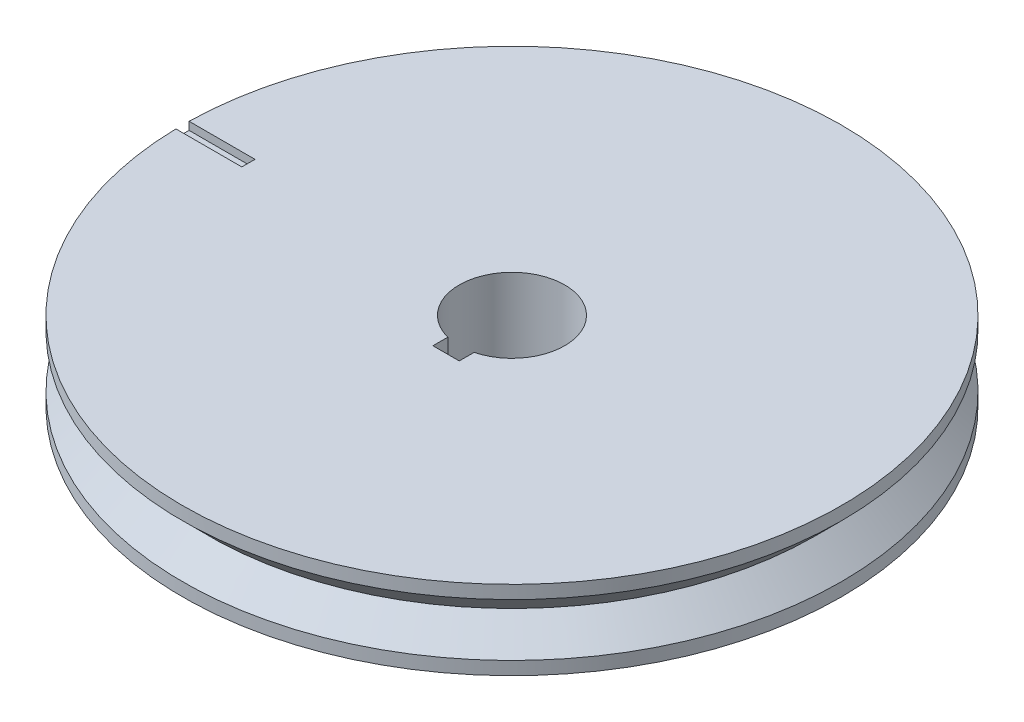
ISO-10303-21;
HEADER;
FILE_DESCRIPTION(('STEP AP214'),'2;1');
FILE_NAME('part.step','',(''),(''),'','','');
FILE_SCHEMA(('AUTOMOTIVE_DESIGN { 1 0 10303 214 1 1 1 1 }'));
ENDSEC;
DATA;
#1=APPLICATION_CONTEXT('core data for automotive mechanical design processes');
#2=APPLICATION_PROTOCOL_DEFINITION('international standard','automotive_design',2000,#1);
#3=PRODUCT_CONTEXT('',#1,'mechanical');
#4=PRODUCT('Part','Part','',(#3));
#5=PRODUCT_RELATED_PRODUCT_CATEGORY('part','',(#4));
#6=PRODUCT_DEFINITION_FORMATION('','',#4);
#7=PRODUCT_DEFINITION_CONTEXT('part definition',#1,'design');
#8=PRODUCT_DEFINITION('design','',#6,#7);
#9=PRODUCT_DEFINITION_SHAPE('','',#8);
#10=(LENGTH_UNIT() NAMED_UNIT(*) SI_UNIT(.MILLI.,.METRE.));
#11=(NAMED_UNIT(*) PLANE_ANGLE_UNIT() SI_UNIT($,.RADIAN.));
#12=(NAMED_UNIT(*) SI_UNIT($,.STERADIAN.) SOLID_ANGLE_UNIT());
#13=UNCERTAINTY_MEASURE_WITH_UNIT(LENGTH_MEASURE(1.E-05),#10,'distance_accuracy_value','');
#14=(GEOMETRIC_REPRESENTATION_CONTEXT(3) GLOBAL_UNCERTAINTY_ASSIGNED_CONTEXT((#13)) GLOBAL_UNIT_ASSIGNED_CONTEXT((#10,
#11,#12)) REPRESENTATION_CONTEXT('',''));
#15=CARTESIAN_POINT('',(0.,0.,0.));
#16=DIRECTION('',(0.,0.,1.));
#17=DIRECTION('',(1.,0.,0.));
#18=AXIS2_PLACEMENT_3D('',#15,#16,#17);
#19=CARTESIAN_POINT('',(0.,-15.,0.));
#20=DIRECTION('',(0.,1.,0.));
#21=DIRECTION('',(-1.,0.,0.));
#22=AXIS2_PLACEMENT_3D('',#19,#20,#21);
#23=PLANE('',#22);
#24=CARTESIAN_POINT('',(0.,-15.,0.));
#25=DIRECTION('',(0.,1.,0.));
#26=DIRECTION('',(-1.,0.,0.));
#27=AXIS2_PLACEMENT_3D('',#24,#25,#26);
#28=CIRCLE('',#27,20.);
#29=CARTESIAN_POINT('',(5.,-15.,19.3649167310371));
#30=VERTEX_POINT('',#29);
#31=CARTESIAN_POINT('',(-5.,-15.,19.3649167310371));
#32=VERTEX_POINT('',#31);
#33=EDGE_CURVE('E150',#30,#32,#28,.T.);
#34=ORIENTED_EDGE('',*,*,#33,.T.);
#35=DIRECTION('',(0.,0.,1.));
#36=VECTOR('',#35,1.);
#37=CARTESIAN_POINT('',(-5.,-15.,19.3649167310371));
#38=LINE('',#37,#36);
#39=CARTESIAN_POINT('',(-5.,-15.,25.));
#40=VERTEX_POINT('',#39);
#41=EDGE_CURVE('E153',#32,#40,#38,.T.);
#42=ORIENTED_EDGE('',*,*,#41,.T.);
#43=DIRECTION('',(1.,0.,0.));
#44=VECTOR('',#43,1.);
#45=CARTESIAN_POINT('',(5.,-15.,25.));
#46=LINE('',#45,#44);
#47=CARTESIAN_POINT('',(5.,-15.,25.));
#48=VERTEX_POINT('',#47);
#49=EDGE_CURVE('E158',#40,#48,#46,.T.);
#50=ORIENTED_EDGE('',*,*,#49,.T.);
#51=DIRECTION('',(0.,0.,-1.));
#52=VECTOR('',#51,1.);
#53=CARTESIAN_POINT('',(5.,-15.,19.3649167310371));
#54=LINE('',#53,#52);
#55=EDGE_CURVE('E53',#48,#30,#54,.T.);
#56=ORIENTED_EDGE('',*,*,#55,.T.);
#57=EDGE_LOOP('',(#34,#42,#50,#56));
#58=FACE_BOUND('',#57,.T.);
#59=CARTESIAN_POINT('',(0.,-15.,0.));
#60=DIRECTION('',(0.,1.,0.));
#61=DIRECTION('',(-1.,0.,0.));
#62=AXIS2_PLACEMENT_3D('',#59,#60,#61);
#63=CIRCLE('',#62,125.);
#64=CARTESIAN_POINT('',(-125.,-15.,0.));
#65=VERTEX_POINT('',#64);
#66=EDGE_CURVE('E11',#65,#65,#63,.T.);
#67=ORIENTED_EDGE('',*,*,#66,.F.);
#68=EDGE_LOOP('',(#67));
#69=FACE_BOUND('',#68,.T.);
#70=ADVANCED_FACE('F31',(#58,#69),#23,.F.);
#71=CARTESIAN_POINT('',(0.,-15.,0.));
#72=DIRECTION('',(0.,1.,0.));
#73=DIRECTION('',(-1.,0.,0.));
#74=AXIS2_PLACEMENT_3D('',#71,#72,#73);
#75=CYLINDRICAL_SURFACE('',#74,125.);
#76=CARTESIAN_POINT('',(0.,-10.,0.));
#77=DIRECTION('',(0.,1.,0.));
#78=DIRECTION('',(-1.,0.,0.));
#79=AXIS2_PLACEMENT_3D('',#76,#77,#78);
#80=CIRCLE('',#79,125.);
#81=CARTESIAN_POINT('',(-125.,-10.,0.));
#82=VERTEX_POINT('',#81);
#83=EDGE_CURVE('E38',#82,#82,#80,.T.);
#84=ORIENTED_EDGE('',*,*,#83,.F.);
#85=EDGE_LOOP('',(#84));
#86=FACE_BOUND('',#85,.T.);
#87=ORIENTED_EDGE('',*,*,#66,.T.);
#88=EDGE_LOOP('',(#87));
#89=FACE_BOUND('',#88,.T.);
#90=ADVANCED_FACE('F136',(#86,#89),#75,.T.);
#91=CARTESIAN_POINT('',(0.,-10.,0.));
#92=DIRECTION('',(0.,-1.,0.));
#93=DIRECTION('',(1.,0.,0.));
#94=AXIS2_PLACEMENT_3D('',#91,#92,#93);
#95=CONICAL_SURFACE('',#94,125.,0.785398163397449);
#96=CARTESIAN_POINT('',(0.,0.,0.));
#97=DIRECTION('',(0.,1.,0.));
#98=DIRECTION('',(-1.,0.,0.));
#99=AXIS2_PLACEMENT_3D('',#96,#97,#98);
#100=CIRCLE('',#99,115.);
#101=CARTESIAN_POINT('',(-115.,0.,0.));
#102=VERTEX_POINT('',#101);
#103=EDGE_CURVE('E122',#102,#102,#100,.T.);
#104=ORIENTED_EDGE('',*,*,#103,.F.);
#105=EDGE_LOOP('',(#104));
#106=FACE_BOUND('',#105,.T.);
#107=ORIENTED_EDGE('',*,*,#83,.T.);
#108=EDGE_LOOP('',(#107));
#109=FACE_BOUND('',#108,.T.);
#110=ADVANCED_FACE('F134',(#106,#109),#95,.T.);
#111=CARTESIAN_POINT('',(0.,0.,0.));
#112=DIRECTION('',(0.,1.,0.));
#113=DIRECTION('',(-1.,0.,0.));
#114=AXIS2_PLACEMENT_3D('',#111,#112,#113);
#115=CONICAL_SURFACE('',#114,115.,0.785398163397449);
#116=CARTESIAN_POINT('',(0.,10.,0.));
#117=DIRECTION('',(0.,1.,0.));
#118=DIRECTION('',(-1.,0.,0.));
#119=AXIS2_PLACEMENT_3D('',#116,#117,#118);
#120=CIRCLE('',#119,125.);
#121=CARTESIAN_POINT('',(-125.,10.,0.));
#122=VERTEX_POINT('',#121);
#123=EDGE_CURVE('E118',#122,#122,#120,.T.);
#124=ORIENTED_EDGE('',*,*,#123,.F.);
#125=EDGE_LOOP('',(#124));
#126=FACE_BOUND('',#125,.T.);
#127=ORIENTED_EDGE('',*,*,#103,.T.);
#128=EDGE_LOOP('',(#127));
#129=FACE_BOUND('',#128,.T.);
#130=ADVANCED_FACE('F227',(#126,#129),#115,.T.);
#131=CARTESIAN_POINT('',(0.,-15.,0.));
#132=DIRECTION('',(0.,1.,0.));
#133=DIRECTION('',(-1.,0.,0.));
#134=AXIS2_PLACEMENT_3D('',#131,#132,#133);
#135=CYLINDRICAL_SURFACE('',#134,125.);
#136=CARTESIAN_POINT('',(0.,15.,0.));
#137=DIRECTION('',(0.,1.,0.));
#138=DIRECTION('',(-1.,0.,0.));
#139=AXIS2_PLACEMENT_3D('',#136,#137,#138);
#140=CIRCLE('',#139,125.);
#141=CARTESIAN_POINT('',(-124.9749974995,15.,2.50000000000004));
#142=VERTEX_POINT('',#141);
#143=CARTESIAN_POINT('',(-124.9749974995,15.,-2.5));
#144=VERTEX_POINT('',#143);
#145=EDGE_CURVE('E111',#142,#144,#140,.T.);
#146=ORIENTED_EDGE('',*,*,#145,.F.);
#147=DIRECTION('',(0.,1.,0.));
#148=VECTOR('',#147,1.);
#149=CARTESIAN_POINT('',(-124.9749974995,12.,2.50000000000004));
#150=LINE('',#149,#148);
#151=CARTESIAN_POINT('',(-124.9749974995,12.,2.50000000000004));
#152=VERTEX_POINT('',#151);
#153=EDGE_CURVE('E113',#152,#142,#150,.T.);
#154=ORIENTED_EDGE('',*,*,#153,.F.);
#155=CARTESIAN_POINT('',(0.,12.,0.));
#156=DIRECTION('',(0.,1.,0.));
#157=DIRECTION('',(-1.,0.,0.));
#158=AXIS2_PLACEMENT_3D('',#155,#156,#157);
#159=CIRCLE('',#158,125.);
#160=CARTESIAN_POINT('',(-124.9749974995,12.,-2.5));
#161=VERTEX_POINT('',#160);
#162=EDGE_CURVE('E112',#161,#152,#159,.T.);
#163=ORIENTED_EDGE('',*,*,#162,.F.);
#164=DIRECTION('',(0.,1.,0.));
#165=VECTOR('',#164,1.);
#166=CARTESIAN_POINT('',(-124.9749974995,12.,-2.5));
#167=LINE('',#166,#165);
#168=EDGE_CURVE('E98',#161,#144,#167,.T.);
#169=ORIENTED_EDGE('',*,*,#168,.T.);
#170=EDGE_LOOP('',(#146,#154,#163,#169));
#171=FACE_BOUND('',#170,.T.);
#172=ORIENTED_EDGE('',*,*,#123,.T.);
#173=EDGE_LOOP('',(#172));
#174=FACE_BOUND('',#173,.T.);
#175=ADVANCED_FACE('F108',(#171,#174),#135,.T.);
#176=CARTESIAN_POINT('',(0.,15.,0.));
#177=DIRECTION('',(0.,-1.,0.));
#178=DIRECTION('',(1.,0.,0.));
#179=AXIS2_PLACEMENT_3D('',#176,#177,#178);
#180=PLANE('',#179);
#181=DIRECTION('',(1.,0.,0.));
#182=VECTOR('',#181,1.);
#183=CARTESIAN_POINT('',(5.,15.,25.));
#184=LINE('',#183,#182);
#185=CARTESIAN_POINT('',(-5.,15.,25.));
#186=VERTEX_POINT('',#185);
#187=CARTESIAN_POINT('',(5.,15.,25.));
#188=VERTEX_POINT('',#187);
#189=EDGE_CURVE('E171',#186,#188,#184,.T.);
#190=ORIENTED_EDGE('',*,*,#189,.F.);
#191=DIRECTION('',(0.,0.,1.));
#192=VECTOR('',#191,1.);
#193=CARTESIAN_POINT('',(-5.,15.,19.3649167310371));
#194=LINE('',#193,#192);
#195=CARTESIAN_POINT('',(-5.,15.,19.3649167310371));
#196=VERTEX_POINT('',#195);
#197=EDGE_CURVE('E175',#196,#186,#194,.T.);
#198=ORIENTED_EDGE('',*,*,#197,.F.);
#199=CARTESIAN_POINT('',(0.,15.,0.));
#200=DIRECTION('',(0.,1.,0.));
#201=DIRECTION('',(-1.,0.,0.));
#202=AXIS2_PLACEMENT_3D('',#199,#200,#201);
#203=CIRCLE('',#202,20.);
#204=CARTESIAN_POINT('',(5.,15.,19.3649167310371));
#205=VERTEX_POINT('',#204);
#206=EDGE_CURVE('E178',#205,#196,#203,.T.);
#207=ORIENTED_EDGE('',*,*,#206,.F.);
#208=DIRECTION('',(0.,0.,-1.));
#209=VECTOR('',#208,1.);
#210=CARTESIAN_POINT('',(5.,15.,19.3649167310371));
#211=LINE('',#210,#209);
#212=EDGE_CURVE('E166',#188,#205,#211,.T.);
#213=ORIENTED_EDGE('',*,*,#212,.F.);
#214=EDGE_LOOP('',(#190,#198,#207,#213));
#215=FACE_BOUND('',#214,.T.);
#216=DIRECTION('',(0.,0.,-1.));
#217=VECTOR('',#216,1.);
#218=CARTESIAN_POINT('',(-99.9749974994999,15.,-2.5));
#219=LINE('',#218,#217);
#220=CARTESIAN_POINT('',(-99.9749974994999,15.,2.5));
#221=VERTEX_POINT('',#220);
#222=CARTESIAN_POINT('',(-99.9749974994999,15.,-2.5));
#223=VERTEX_POINT('',#222);
#224=EDGE_CURVE('E45',#221,#223,#219,.T.);
#225=ORIENTED_EDGE('',*,*,#224,.F.);
#226=DIRECTION('',(1.,0.,0.));
#227=VECTOR('',#226,1.);
#228=CARTESIAN_POINT('',(-99.9749974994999,15.,2.5));
#229=LINE('',#228,#227);
#230=EDGE_CURVE('E103',#142,#221,#229,.T.);
#231=ORIENTED_EDGE('',*,*,#230,.F.);
#232=ORIENTED_EDGE('',*,*,#145,.T.);
#233=DIRECTION('',(-1.,0.,0.));
#234=VECTOR('',#233,1.);
#235=CARTESIAN_POINT('',(-99.9749974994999,15.,-2.5));
#236=LINE('',#235,#234);
#237=EDGE_CURVE('E94',#223,#144,#236,.T.);
#238=ORIENTED_EDGE('',*,*,#237,.F.);
#239=EDGE_LOOP('',(#225,#231,#232,#238));
#240=FACE_BOUND('',#239,.T.);
#241=ADVANCED_FACE('F116',(#215,#240),#180,.F.);
#242=CARTESIAN_POINT('',(-5.,-15.,19.3649167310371));
#243=DIRECTION('',(-1.,0.,0.));
#244=DIRECTION('',(0.,0.,1.));
#245=AXIS2_PLACEMENT_3D('',#242,#243,#244);
#246=PLANE('',#245);
#247=ORIENTED_EDGE('',*,*,#197,.T.);
#248=DIRECTION('',(0.,1.,0.));
#249=VECTOR('',#248,1.);
#250=CARTESIAN_POINT('',(-5.,-15.,25.));
#251=LINE('',#250,#249);
#252=EDGE_CURVE('E127',#40,#186,#251,.T.);
#253=ORIENTED_EDGE('',*,*,#252,.F.);
#254=ORIENTED_EDGE('',*,*,#41,.F.);
#255=DIRECTION('',(0.,1.,0.));
#256=VECTOR('',#255,1.);
#257=CARTESIAN_POINT('',(-5.,-15.,19.3649167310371));
#258=LINE('',#257,#256);
#259=EDGE_CURVE('E119',#32,#196,#258,.T.);
#260=ORIENTED_EDGE('',*,*,#259,.T.);
#261=EDGE_LOOP('',(#247,#253,#254,#260));
#262=FACE_BOUND('',#261,.T.);
#263=ADVANCED_FACE('F219',(#262),#246,.F.);
#264=CARTESIAN_POINT('',(0.,-15.,0.));
#265=DIRECTION('',(0.,1.,0.));
#266=DIRECTION('',(-1.,0.,0.));
#267=AXIS2_PLACEMENT_3D('',#264,#265,#266);
#268=CYLINDRICAL_SURFACE('',#267,20.);
#269=ORIENTED_EDGE('',*,*,#206,.T.);
#270=ORIENTED_EDGE('',*,*,#259,.F.);
#271=ORIENTED_EDGE('',*,*,#33,.F.);
#272=DIRECTION('',(0.,1.,0.));
#273=VECTOR('',#272,1.);
#274=CARTESIAN_POINT('',(5.,-15.,19.3649167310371));
#275=LINE('',#274,#273);
#276=EDGE_CURVE('E124',#30,#205,#275,.T.);
#277=ORIENTED_EDGE('',*,*,#276,.T.);
#278=EDGE_LOOP('',(#269,#270,#271,#277));
#279=FACE_BOUND('',#278,.T.);
#280=ADVANCED_FACE('F216',(#279),#268,.F.);
#281=CARTESIAN_POINT('',(5.,-15.,19.3649167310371));
#282=DIRECTION('',(1.,0.,0.));
#283=DIRECTION('',(0.,0.,-1.));
#284=AXIS2_PLACEMENT_3D('',#281,#282,#283);
#285=PLANE('',#284);
#286=ORIENTED_EDGE('',*,*,#212,.T.);
#287=ORIENTED_EDGE('',*,*,#276,.F.);
#288=ORIENTED_EDGE('',*,*,#55,.F.);
#289=DIRECTION('',(0.,1.,0.));
#290=VECTOR('',#289,1.);
#291=CARTESIAN_POINT('',(5.,-15.,25.));
#292=LINE('',#291,#290);
#293=EDGE_CURVE('E157',#48,#188,#292,.T.);
#294=ORIENTED_EDGE('',*,*,#293,.T.);
#295=EDGE_LOOP('',(#286,#287,#288,#294));
#296=FACE_BOUND('',#295,.T.);
#297=ADVANCED_FACE('F164',(#296),#285,.F.);
#298=CARTESIAN_POINT('',(5.,-15.,25.));
#299=DIRECTION('',(0.,0.,1.));
#300=DIRECTION('',(1.,0.,0.));
#301=AXIS2_PLACEMENT_3D('',#298,#299,#300);
#302=PLANE('',#301);
#303=ORIENTED_EDGE('',*,*,#189,.T.);
#304=ORIENTED_EDGE('',*,*,#293,.F.);
#305=ORIENTED_EDGE('',*,*,#49,.F.);
#306=ORIENTED_EDGE('',*,*,#252,.T.);
#307=EDGE_LOOP('',(#303,#304,#305,#306));
#308=FACE_BOUND('',#307,.T.);
#309=ADVANCED_FACE('F172',(#308),#302,.F.);
#310=CARTESIAN_POINT('',(-99.9749974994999,12.,-2.5));
#311=DIRECTION('',(1.,0.,0.));
#312=DIRECTION('',(0.,1.,0.));
#313=AXIS2_PLACEMENT_3D('',#310,#311,#312);
#314=PLANE('',#313);
#315=ORIENTED_EDGE('',*,*,#224,.T.);
#316=DIRECTION('',(0.,1.,0.));
#317=VECTOR('',#316,1.);
#318=CARTESIAN_POINT('',(-99.9749974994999,12.,-2.5));
#319=LINE('',#318,#317);
#320=CARTESIAN_POINT('',(-99.9749974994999,12.,-2.5));
#321=VERTEX_POINT('',#320);
#322=EDGE_CURVE('E100',#321,#223,#319,.T.);
#323=ORIENTED_EDGE('',*,*,#322,.F.);
#324=DIRECTION('',(0.,0.,-1.));
#325=VECTOR('',#324,1.);
#326=CARTESIAN_POINT('',(-99.9749974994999,12.,-2.5));
#327=LINE('',#326,#325);
#328=CARTESIAN_POINT('',(-99.9749974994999,12.,2.5));
#329=VERTEX_POINT('',#328);
#330=EDGE_CURVE('E194',#329,#321,#327,.T.);
#331=ORIENTED_EDGE('',*,*,#330,.F.);
#332=DIRECTION('',(0.,1.,0.));
#333=VECTOR('',#332,1.);
#334=CARTESIAN_POINT('',(-99.9749974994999,12.,2.5));
#335=LINE('',#334,#333);
#336=EDGE_CURVE('E184',#329,#221,#335,.T.);
#337=ORIENTED_EDGE('',*,*,#336,.T.);
#338=EDGE_LOOP('',(#315,#323,#331,#337));
#339=FACE_BOUND('',#338,.T.);
#340=ADVANCED_FACE('F204',(#339),#314,.F.);
#341=CARTESIAN_POINT('',(-99.9749974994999,12.,2.5));
#342=DIRECTION('',(0.,0.,1.));
#343=DIRECTION('',(1.,0.,0.));
#344=AXIS2_PLACEMENT_3D('',#341,#342,#343);
#345=PLANE('',#344);
#346=ORIENTED_EDGE('',*,*,#230,.T.);
#347=ORIENTED_EDGE('',*,*,#336,.F.);
#348=DIRECTION('',(1.,0.,0.));
#349=VECTOR('',#348,1.);
#350=CARTESIAN_POINT('',(-99.9749974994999,12.,2.5));
#351=LINE('',#350,#349);
#352=EDGE_CURVE('E185',#152,#329,#351,.T.);
#353=ORIENTED_EDGE('',*,*,#352,.F.);
#354=ORIENTED_EDGE('',*,*,#153,.T.);
#355=EDGE_LOOP('',(#346,#347,#353,#354));
#356=FACE_BOUND('',#355,.T.);
#357=ADVANCED_FACE('F199',(#356),#345,.F.);
#358=CARTESIAN_POINT('',(-99.9749974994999,12.,-2.5));
#359=DIRECTION('',(0.,0.,-1.));
#360=DIRECTION('',(-1.,0.,0.));
#361=AXIS2_PLACEMENT_3D('',#358,#359,#360);
#362=PLANE('',#361);
#363=ORIENTED_EDGE('',*,*,#237,.T.);
#364=ORIENTED_EDGE('',*,*,#168,.F.);
#365=DIRECTION('',(-1.,0.,0.));
#366=VECTOR('',#365,1.);
#367=CARTESIAN_POINT('',(-99.9749974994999,12.,-2.5));
#368=LINE('',#367,#366);
#369=EDGE_CURVE('E192',#321,#161,#368,.T.);
#370=ORIENTED_EDGE('',*,*,#369,.F.);
#371=ORIENTED_EDGE('',*,*,#322,.T.);
#372=EDGE_LOOP('',(#363,#364,#370,#371));
#373=FACE_BOUND('',#372,.T.);
#374=ADVANCED_FACE('F96',(#373),#362,.F.);
#375=CARTESIAN_POINT('',(0.,12.,0.));
#376=DIRECTION('',(0.,1.,0.));
#377=DIRECTION('',(-1.,0.,0.));
#378=AXIS2_PLACEMENT_3D('',#375,#376,#377);
#379=PLANE('',#378);
#380=ORIENTED_EDGE('',*,*,#330,.T.);
#381=ORIENTED_EDGE('',*,*,#369,.T.);
#382=ORIENTED_EDGE('',*,*,#162,.T.);
#383=ORIENTED_EDGE('',*,*,#352,.T.);
#384=EDGE_LOOP('',(#380,#381,#382,#383));
#385=FACE_BOUND('',#384,.T.);
#386=ADVANCED_FACE('F203',(#385),#379,.T.);
#387=CLOSED_SHELL('',(#70,#90,#110,#130,#175,#241,#263,#280,#297,#309,#340,#357,#374,#386));
#388=MANIFOLD_SOLID_BREP('B2',#387);
#389=ADVANCED_BREP_SHAPE_REPRESENTATION('',(#18,#388),#14);
#390=SHAPE_DEFINITION_REPRESENTATION(#9,#389);
ENDSEC;
END-ISO-10303-21;
